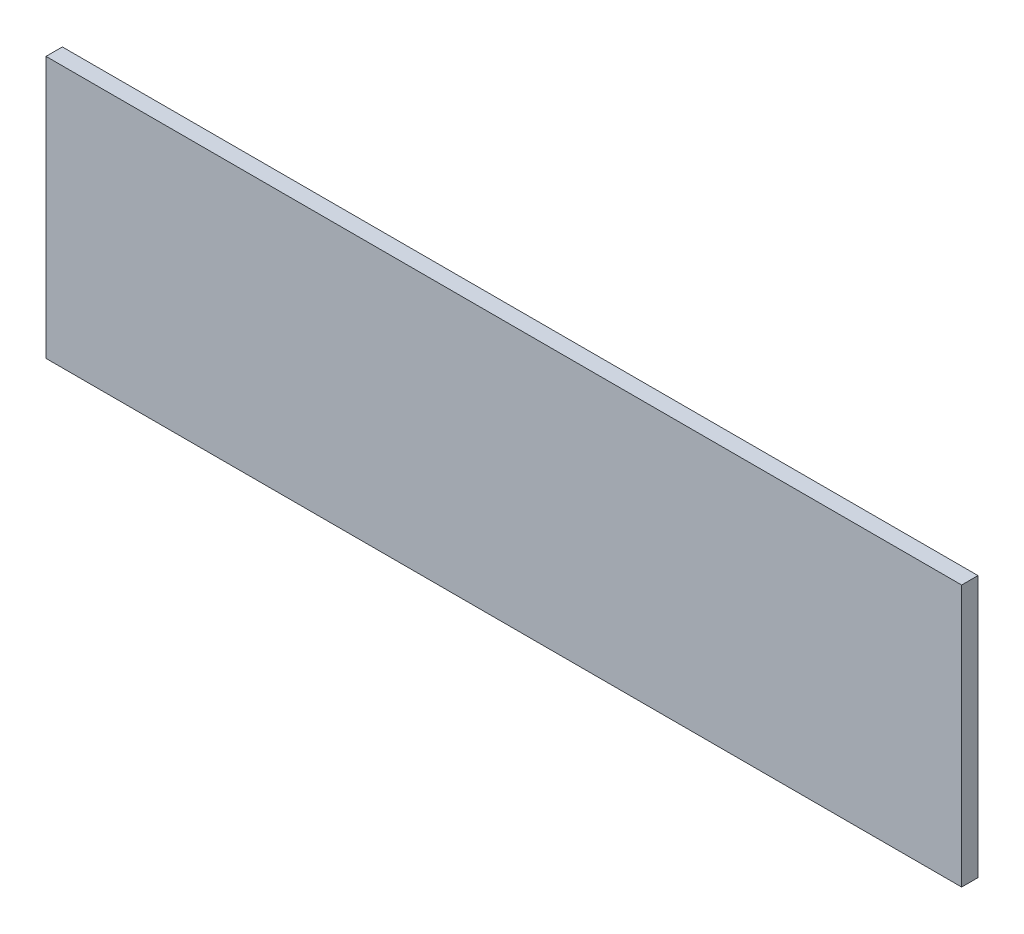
ISO-10303-21;
HEADER;
FILE_DESCRIPTION(('STEP AP214'),'2;1');
FILE_NAME('part.step','',(''),(''),'','','');
FILE_SCHEMA(('AUTOMOTIVE_DESIGN { 1 0 10303 214 1 1 1 1 }'));
ENDSEC;
DATA;
#1=APPLICATION_CONTEXT('core data for automotive mechanical design processes');
#2=APPLICATION_PROTOCOL_DEFINITION('international standard','automotive_design',2000,#1);
#3=PRODUCT_CONTEXT('',#1,'mechanical');
#4=PRODUCT('Part','Part','',(#3));
#5=PRODUCT_RELATED_PRODUCT_CATEGORY('part','',(#4));
#6=PRODUCT_DEFINITION_FORMATION('','',#4);
#7=PRODUCT_DEFINITION_CONTEXT('part definition',#1,'design');
#8=PRODUCT_DEFINITION('design','',#6,#7);
#9=PRODUCT_DEFINITION_SHAPE('','',#8);
#10=(LENGTH_UNIT() NAMED_UNIT(*) SI_UNIT(.MILLI.,.METRE.));
#11=(NAMED_UNIT(*) PLANE_ANGLE_UNIT() SI_UNIT($,.RADIAN.));
#12=(NAMED_UNIT(*) SI_UNIT($,.STERADIAN.) SOLID_ANGLE_UNIT());
#13=UNCERTAINTY_MEASURE_WITH_UNIT(LENGTH_MEASURE(1.E-05),#10,'distance_accuracy_value','');
#14=(GEOMETRIC_REPRESENTATION_CONTEXT(3) GLOBAL_UNCERTAINTY_ASSIGNED_CONTEXT((#13)) GLOBAL_UNIT_ASSIGNED_CONTEXT((#10,
#11,#12)) REPRESENTATION_CONTEXT('',''));
#15=CARTESIAN_POINT('',(0.,0.,0.));
#16=DIRECTION('',(0.,0.,1.));
#17=DIRECTION('',(1.,0.,0.));
#18=AXIS2_PLACEMENT_3D('',#15,#16,#17);
#19=CARTESIAN_POINT('',(0.,0.,5.));
#20=DIRECTION('',(1.,0.,0.));
#21=DIRECTION('',(0.,0.,-1.));
#22=AXIS2_PLACEMENT_3D('',#19,#20,#21);
#23=PLANE('',#22);
#24=DIRECTION('',(0.,-1.,0.));
#25=VECTOR('',#24,1.);
#26=CARTESIAN_POINT('',(0.,0.,0.));
#27=LINE('',#26,#25);
#28=CARTESIAN_POINT('',(0.,80.,0.));
#29=VERTEX_POINT('',#28);
#30=CARTESIAN_POINT('',(0.,0.,0.));
#31=VERTEX_POINT('',#30);
#32=EDGE_CURVE('E75',#29,#31,#27,.T.);
#33=ORIENTED_EDGE('',*,*,#32,.T.);
#34=DIRECTION('',(0.,0.,-1.));
#35=VECTOR('',#34,1.);
#36=CARTESIAN_POINT('',(0.,0.,5.));
#37=LINE('',#36,#35);
#38=CARTESIAN_POINT('',(0.,0.,5.));
#39=VERTEX_POINT('',#38);
#40=EDGE_CURVE('E11',#39,#31,#37,.T.);
#41=ORIENTED_EDGE('',*,*,#40,.F.);
#42=DIRECTION('',(0.,-1.,0.));
#43=VECTOR('',#42,1.);
#44=CARTESIAN_POINT('',(0.,0.,5.));
#45=LINE('',#44,#43);
#46=CARTESIAN_POINT('',(0.,80.,5.));
#47=VERTEX_POINT('',#46);
#48=EDGE_CURVE('E93',#47,#39,#45,.T.);
#49=ORIENTED_EDGE('',*,*,#48,.F.);
#50=DIRECTION('',(0.,0.,-1.));
#51=VECTOR('',#50,1.);
#52=CARTESIAN_POINT('',(0.,80.,5.));
#53=LINE('',#52,#51);
#54=EDGE_CURVE('E87',#47,#29,#53,.T.);
#55=ORIENTED_EDGE('',*,*,#54,.T.);
#56=EDGE_LOOP('',(#33,#41,#49,#55));
#57=FACE_BOUND('',#56,.T.);
#58=ADVANCED_FACE('F31',(#57),#23,.F.);
#59=CARTESIAN_POINT('',(0.,0.,5.));
#60=DIRECTION('',(0.,1.,0.));
#61=DIRECTION('',(0.,0.,1.));
#62=AXIS2_PLACEMENT_3D('',#59,#60,#61);
#63=PLANE('',#62);
#64=DIRECTION('',(1.,0.,0.));
#65=VECTOR('',#64,1.);
#66=CARTESIAN_POINT('',(0.,0.,0.));
#67=LINE('',#66,#65);
#68=CARTESIAN_POINT('',(280.,-6.10622663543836E-13,0.));
#69=VERTEX_POINT('',#68);
#70=EDGE_CURVE('E71',#31,#69,#67,.T.);
#71=ORIENTED_EDGE('',*,*,#70,.T.);
#72=DIRECTION('',(0.,0.,-1.));
#73=VECTOR('',#72,1.);
#74=CARTESIAN_POINT('',(280.,-6.10622663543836E-13,5.));
#75=LINE('',#74,#73);
#76=CARTESIAN_POINT('',(280.,-6.10622663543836E-13,5.));
#77=VERTEX_POINT('',#76);
#78=EDGE_CURVE('E38',#77,#69,#75,.T.);
#79=ORIENTED_EDGE('',*,*,#78,.F.);
#80=DIRECTION('',(1.,0.,0.));
#81=VECTOR('',#80,1.);
#82=CARTESIAN_POINT('',(0.,0.,5.));
#83=LINE('',#82,#81);
#84=EDGE_CURVE('E83',#39,#77,#83,.T.);
#85=ORIENTED_EDGE('',*,*,#84,.F.);
#86=ORIENTED_EDGE('',*,*,#40,.T.);
#87=EDGE_LOOP('',(#71,#79,#85,#86));
#88=FACE_BOUND('',#87,.T.);
#89=ADVANCED_FACE('F82',(#88),#63,.F.);
#90=CARTESIAN_POINT('',(280.,-6.10622663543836E-13,5.));
#91=DIRECTION('',(-1.,0.,0.));
#92=DIRECTION('',(0.,0.,1.));
#93=AXIS2_PLACEMENT_3D('',#90,#91,#92);
#94=PLANE('',#93);
#95=DIRECTION('',(0.,1.,0.));
#96=VECTOR('',#95,1.);
#97=CARTESIAN_POINT('',(280.,-6.10622663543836E-13,0.));
#98=LINE('',#97,#96);
#99=CARTESIAN_POINT('',(280.,80.,0.));
#100=VERTEX_POINT('',#99);
#101=EDGE_CURVE('E76',#69,#100,#98,.T.);
#102=ORIENTED_EDGE('',*,*,#101,.T.);
#103=DIRECTION('',(0.,0.,-1.));
#104=VECTOR('',#103,1.);
#105=CARTESIAN_POINT('',(280.,80.,5.));
#106=LINE('',#105,#104);
#107=CARTESIAN_POINT('',(280.,80.,5.));
#108=VERTEX_POINT('',#107);
#109=EDGE_CURVE('E99',#108,#100,#106,.T.);
#110=ORIENTED_EDGE('',*,*,#109,.F.);
#111=DIRECTION('',(0.,1.,0.));
#112=VECTOR('',#111,1.);
#113=CARTESIAN_POINT('',(280.,-6.10622663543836E-13,5.));
#114=LINE('',#113,#112);
#115=EDGE_CURVE('E50',#77,#108,#114,.T.);
#116=ORIENTED_EDGE('',*,*,#115,.F.);
#117=ORIENTED_EDGE('',*,*,#78,.T.);
#118=EDGE_LOOP('',(#102,#110,#116,#117));
#119=FACE_BOUND('',#118,.T.);
#120=ADVANCED_FACE('F102',(#119),#94,.F.);
#121=CARTESIAN_POINT('',(0.,80.,5.));
#122=DIRECTION('',(0.,-1.,0.));
#123=DIRECTION('',(0.,0.,-1.));
#124=AXIS2_PLACEMENT_3D('',#121,#122,#123);
#125=PLANE('',#124);
#126=DIRECTION('',(-1.,0.,0.));
#127=VECTOR('',#126,1.);
#128=CARTESIAN_POINT('',(0.,80.,0.));
#129=LINE('',#128,#127);
#130=EDGE_CURVE('E91',#100,#29,#129,.T.);
#131=ORIENTED_EDGE('',*,*,#130,.T.);
#132=ORIENTED_EDGE('',*,*,#54,.F.);
#133=DIRECTION('',(-1.,0.,0.));
#134=VECTOR('',#133,1.);
#135=CARTESIAN_POINT('',(0.,80.,5.));
#136=LINE('',#135,#134);
#137=EDGE_CURVE('E45',#108,#47,#136,.T.);
#138=ORIENTED_EDGE('',*,*,#137,.F.);
#139=ORIENTED_EDGE('',*,*,#109,.T.);
#140=EDGE_LOOP('',(#131,#132,#138,#139));
#141=FACE_BOUND('',#140,.T.);
#142=ADVANCED_FACE('F104',(#141),#125,.F.);
#143=CARTESIAN_POINT('',(0.,80.,5.));
#144=DIRECTION('',(0.,0.,-1.));
#145=DIRECTION('',(-1.,0.,0.));
#146=AXIS2_PLACEMENT_3D('',#143,#144,#145);
#147=PLANE('',#146);
#148=ORIENTED_EDGE('',*,*,#48,.T.);
#149=ORIENTED_EDGE('',*,*,#84,.T.);
#150=ORIENTED_EDGE('',*,*,#115,.T.);
#151=ORIENTED_EDGE('',*,*,#137,.T.);
#152=EDGE_LOOP('',(#148,#149,#150,#151));
#153=FACE_BOUND('',#152,.T.);
#154=ADVANCED_FACE('F105',(#153),#147,.F.);
#155=CARTESIAN_POINT('',(0.,80.,0.));
#156=DIRECTION('',(0.,0.,-1.));
#157=DIRECTION('',(-1.,0.,0.));
#158=AXIS2_PLACEMENT_3D('',#155,#156,#157);
#159=PLANE('',#158);
#160=ORIENTED_EDGE('',*,*,#32,.F.);
#161=ORIENTED_EDGE('',*,*,#130,.F.);
#162=ORIENTED_EDGE('',*,*,#101,.F.);
#163=ORIENTED_EDGE('',*,*,#70,.F.);
#164=EDGE_LOOP('',(#160,#161,#162,#163));
#165=FACE_BOUND('',#164,.T.);
#166=ADVANCED_FACE('F72',(#165),#159,.T.);
#167=CLOSED_SHELL('',(#58,#89,#120,#142,#154,#166));
#168=MANIFOLD_SOLID_BREP('B2',#167);
#169=ADVANCED_BREP_SHAPE_REPRESENTATION('',(#18,#168),#14);
#170=SHAPE_DEFINITION_REPRESENTATION(#9,#169);
ENDSEC;
END-ISO-10303-21;
